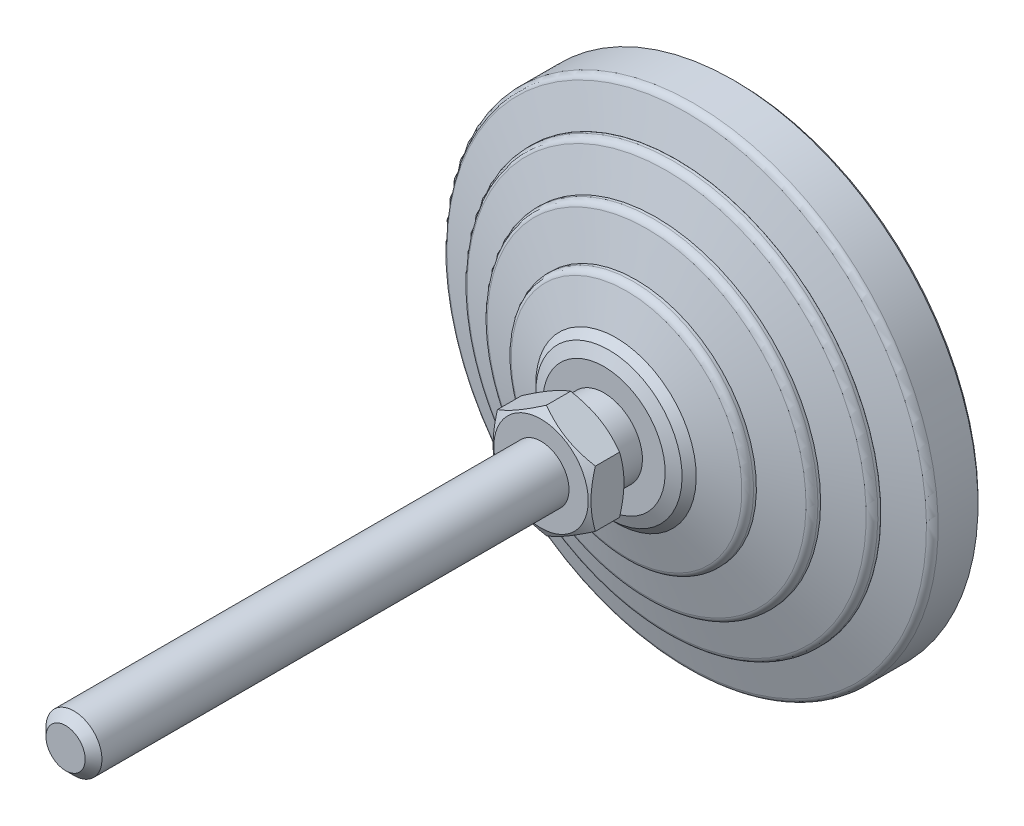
ISO-10303-21;
HEADER;
FILE_DESCRIPTION(('STEP AP214'),'2;1');
FILE_NAME('part.step','',(''),(''),'','','');
FILE_SCHEMA(('AUTOMOTIVE_DESIGN { 1 0 10303 214 1 1 1 1 }'));
ENDSEC;
DATA;
#1=APPLICATION_CONTEXT('core data for automotive mechanical design processes');
#2=APPLICATION_PROTOCOL_DEFINITION('international standard','automotive_design',2000,#1);
#3=PRODUCT_CONTEXT('',#1,'mechanical');
#4=PRODUCT('Part','Part','',(#3));
#5=PRODUCT_RELATED_PRODUCT_CATEGORY('part','',(#4));
#6=PRODUCT_DEFINITION_FORMATION('','',#4);
#7=PRODUCT_DEFINITION_CONTEXT('part definition',#1,'design');
#8=PRODUCT_DEFINITION('design','',#6,#7);
#9=PRODUCT_DEFINITION_SHAPE('','',#8);
#10=(LENGTH_UNIT() NAMED_UNIT(*) SI_UNIT(.MILLI.,.METRE.));
#11=(NAMED_UNIT(*) PLANE_ANGLE_UNIT() SI_UNIT($,.RADIAN.));
#12=(NAMED_UNIT(*) SI_UNIT($,.STERADIAN.) SOLID_ANGLE_UNIT());
#13=UNCERTAINTY_MEASURE_WITH_UNIT(LENGTH_MEASURE(1.E-05),#10,'distance_accuracy_value','');
#14=(GEOMETRIC_REPRESENTATION_CONTEXT(3) GLOBAL_UNCERTAINTY_ASSIGNED_CONTEXT((#13)) GLOBAL_UNIT_ASSIGNED_CONTEXT((#10,
#11,#12)) REPRESENTATION_CONTEXT('',''));
#15=CARTESIAN_POINT('',(0.,0.,0.));
#16=DIRECTION('',(0.,0.,1.));
#17=DIRECTION('',(1.,0.,0.));
#18=AXIS2_PLACEMENT_3D('',#15,#16,#17);
#19=CARTESIAN_POINT('',(-5.49999999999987,0.,23.));
#20=DIRECTION('',(0.,0.,1.));
#21=DIRECTION('',(0.,-1.,0.));
#22=AXIS2_PLACEMENT_3D('',#19,#20,#21);
#23=PLANE('',#22);
#24=CARTESIAN_POINT('',(0.,0.,23.));
#25=DIRECTION('',(0.,0.,1.));
#26=DIRECTION('',(1.,0.,0.));
#27=AXIS2_PLACEMENT_3D('',#24,#25,#26);
#28=CIRCLE('',#27,6.75);
#29=CARTESIAN_POINT('',(6.75,0.,23.));
#30=VERTEX_POINT('',#29);
#31=EDGE_CURVE('E570',#30,#30,#28,.T.);
#32=ORIENTED_EDGE('',*,*,#31,.F.);
#33=EDGE_LOOP('',(#32));
#34=FACE_BOUND('',#33,.T.);
#35=CARTESIAN_POINT('',(0.,0.,23.));
#36=DIRECTION('',(0.,0.,-1.));
#37=DIRECTION('',(0.,1.,0.));
#38=AXIS2_PLACEMENT_3D('',#35,#36,#37);
#39=CIRCLE('',#38,5.49999999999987);
#40=CARTESIAN_POINT('',(0.,5.49999999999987,23.));
#41=VERTEX_POINT('',#40);
#42=EDGE_CURVE('E150',#41,#41,#39,.T.);
#43=ORIENTED_EDGE('',*,*,#42,.F.);
#44=EDGE_LOOP('',(#43));
#45=FACE_BOUND('',#44,.T.);
#46=ADVANCED_FACE('F14',(#34,#45),#23,.F.);
#47=CARTESIAN_POINT('',(0.,0.,0.));
#48=DIRECTION('',(0.,0.,-1.));
#49=DIRECTION('',(0.,1.,0.));
#50=AXIS2_PLACEMENT_3D('',#47,#48,#49);
#51=CYLINDRICAL_SURFACE('',#50,5.49999999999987);
#52=CARTESIAN_POINT('',(0.,0.,19.));
#53=DIRECTION('',(0.,0.,-1.));
#54=DIRECTION('',(0.,1.,0.));
#55=AXIS2_PLACEMENT_3D('',#52,#53,#54);
#56=CIRCLE('',#55,5.49999999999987);
#57=CARTESIAN_POINT('',(0.,5.49999999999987,19.));
#58=VERTEX_POINT('',#57);
#59=EDGE_CURVE('E147',#58,#58,#56,.T.);
#60=ORIENTED_EDGE('',*,*,#59,.F.);
#61=EDGE_LOOP('',(#60));
#62=FACE_BOUND('',#61,.T.);
#63=ORIENTED_EDGE('',*,*,#42,.T.);
#64=EDGE_LOOP('',(#63));
#65=FACE_BOUND('',#64,.T.);
#66=ADVANCED_FACE('F174',(#62,#65),#51,.T.);
#67=CARTESIAN_POINT('',(-8.7540983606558,0.,19.));
#68=DIRECTION('',(0.,0.,-1.));
#69=DIRECTION('',(0.,1.,0.));
#70=AXIS2_PLACEMENT_3D('',#67,#68,#69);
#71=PLANE('',#70);
#72=CARTESIAN_POINT('',(0.,0.,19.));
#73=DIRECTION('',(0.,0.,-1.));
#74=DIRECTION('',(0.,1.,0.));
#75=AXIS2_PLACEMENT_3D('',#72,#73,#74);
#76=CIRCLE('',#75,8.7540983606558);
#77=CARTESIAN_POINT('',(0.,8.7540983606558,19.));
#78=VERTEX_POINT('',#77);
#79=EDGE_CURVE('E144',#78,#78,#76,.T.);
#80=ORIENTED_EDGE('',*,*,#79,.F.);
#81=EDGE_LOOP('',(#80));
#82=FACE_BOUND('',#81,.T.);
#83=ORIENTED_EDGE('',*,*,#59,.T.);
#84=EDGE_LOOP('',(#83));
#85=FACE_BOUND('',#84,.T.);
#86=ADVANCED_FACE('F181',(#82,#85),#71,.F.);
#87=CARTESIAN_POINT('',(0.,0.,19.));
#88=DIRECTION('',(0.,0.,-1.));
#89=DIRECTION('',(0.,1.,0.));
#90=AXIS2_PLACEMENT_3D('',#87,#88,#89);
#91=CONICAL_SURFACE('',#90,8.7540983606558,1.17809724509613);
#92=CARTESIAN_POINT('',(0.,0.,18.2928932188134));
#93=DIRECTION('',(0.,0.,-1.));
#94=DIRECTION('',(0.,1.,0.));
#95=AXIS2_PLACEMENT_3D('',#92,#93,#94);
#96=CIRCLE('',#95,10.4612051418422);
#97=CARTESIAN_POINT('',(0.,10.4612051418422,18.2928932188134));
#98=VERTEX_POINT('',#97);
#99=EDGE_CURVE('E141',#98,#98,#96,.T.);
#100=ORIENTED_EDGE('',*,*,#99,.F.);
#101=EDGE_LOOP('',(#100));
#102=FACE_BOUND('',#101,.T.);
#103=ORIENTED_EDGE('',*,*,#79,.T.);
#104=EDGE_LOOP('',(#103));
#105=FACE_BOUND('',#104,.T.);
#106=ADVANCED_FACE('F433',(#102,#105),#91,.T.);
#107=CARTESIAN_POINT('',(0.,0.,18.2928932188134));
#108=DIRECTION('',(0.,0.,-1.));
#109=DIRECTION('',(0.,1.,0.));
#110=AXIS2_PLACEMENT_3D('',#107,#108,#109);
#111=CONICAL_SURFACE('',#110,10.4612051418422,0.785398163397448);
#112=CARTESIAN_POINT('',(0.,0.,17.2786885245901));
#113=DIRECTION('',(0.,0.,-1.));
#114=DIRECTION('',(0.,1.,0.));
#115=AXIS2_PLACEMENT_3D('',#112,#113,#114);
#116=CIRCLE('',#115,11.4754098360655);
#117=CARTESIAN_POINT('',(0.,11.4754098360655,17.2786885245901));
#118=VERTEX_POINT('',#117);
#119=EDGE_CURVE('E138',#118,#118,#116,.T.);
#120=ORIENTED_EDGE('',*,*,#119,.F.);
#121=EDGE_LOOP('',(#120));
#122=FACE_BOUND('',#121,.T.);
#123=ORIENTED_EDGE('',*,*,#99,.T.);
#124=EDGE_LOOP('',(#123));
#125=FACE_BOUND('',#124,.T.);
#126=ADVANCED_FACE('F423',(#122,#125),#111,.T.);
#127=CARTESIAN_POINT('',(0.,0.,17.2786885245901));
#128=DIRECTION('',(0.,0.,-1.));
#129=DIRECTION('',(0.,1.,0.));
#130=AXIS2_PLACEMENT_3D('',#127,#128,#129);
#131=CONICAL_SURFACE('',#130,11.4754098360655,1.27933953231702);
#132=CARTESIAN_POINT('',(0.,0.,15.7711726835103));
#133=DIRECTION('',(0.,0.,-1.));
#134=DIRECTION('',(0.,1.,0.));
#135=AXIS2_PLACEMENT_3D('',#132,#133,#134);
#136=CIRCLE('',#135,16.5004626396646);
#137=CARTESIAN_POINT('',(0.,16.5004626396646,15.7711726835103));
#138=VERTEX_POINT('',#137);
#139=EDGE_CURVE('E135',#138,#138,#136,.T.);
#140=ORIENTED_EDGE('',*,*,#139,.F.);
#141=EDGE_LOOP('',(#140));
#142=FACE_BOUND('',#141,.T.);
#143=ORIENTED_EDGE('',*,*,#119,.T.);
#144=EDGE_LOOP('',(#143));
#145=FACE_BOUND('',#144,.T.);
#146=ADVANCED_FACE('F413',(#142,#145),#131,.T.);
#147=CARTESIAN_POINT('',(0.,0.,14.8133463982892));
#148=DIRECTION('',(0.,0.,-1.));
#149=DIRECTION('',(0.,1.,0.));
#150=AXIS2_PLACEMENT_3D('',#147,#148,#149);
#151=TOROIDAL_SURFACE('',#150,16.2131147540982,1.);
#152=CARTESIAN_POINT('',(0.,0.,14.8133463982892));
#153=DIRECTION('',(0.,0.,-1.));
#154=DIRECTION('',(0.,1.,0.));
#155=AXIS2_PLACEMENT_3D('',#152,#153,#154);
#156=CIRCLE('',#155,17.2131147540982);
#157=CARTESIAN_POINT('',(0.,17.2131147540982,14.8133463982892));
#158=VERTEX_POINT('',#157);
#159=EDGE_CURVE('E132',#158,#158,#156,.T.);
#160=ORIENTED_EDGE('',*,*,#159,.F.);
#161=EDGE_LOOP('',(#160));
#162=FACE_BOUND('',#161,.T.);
#163=ORIENTED_EDGE('',*,*,#139,.T.);
#164=EDGE_LOOP('',(#163));
#165=FACE_BOUND('',#164,.T.);
#166=ADVANCED_FACE('F403',(#162,#165),#151,.T.);
#167=CARTESIAN_POINT('',(0.,0.,0.));
#168=DIRECTION('',(0.,0.,-1.));
#169=DIRECTION('',(0.,1.,0.));
#170=AXIS2_PLACEMENT_3D('',#167,#168,#169);
#171=CYLINDRICAL_SURFACE('',#170,17.2131147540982);
#172=CARTESIAN_POINT('',(0.,0.,14.4098360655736));
#173=DIRECTION('',(0.,0.,-1.));
#174=DIRECTION('',(0.,1.,0.));
#175=AXIS2_PLACEMENT_3D('',#172,#173,#174);
#176=CIRCLE('',#175,17.2131147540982);
#177=CARTESIAN_POINT('',(0.,17.2131147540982,14.4098360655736));
#178=VERTEX_POINT('',#177);
#179=EDGE_CURVE('E129',#178,#178,#176,.T.);
#180=ORIENTED_EDGE('',*,*,#179,.F.);
#181=EDGE_LOOP('',(#180));
#182=FACE_BOUND('',#181,.T.);
#183=ORIENTED_EDGE('',*,*,#159,.T.);
#184=EDGE_LOOP('',(#183));
#185=FACE_BOUND('',#184,.T.);
#186=ADVANCED_FACE('F393',(#182,#185),#171,.T.);
#187=CARTESIAN_POINT('',(0.,0.,14.4098360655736));
#188=DIRECTION('',(0.,0.,-1.));
#189=DIRECTION('',(0.,1.,0.));
#190=AXIS2_PLACEMENT_3D('',#187,#188,#189);
#191=CONICAL_SURFACE('',#190,17.2131147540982,1.30454427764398);
#192=CARTESIAN_POINT('',(0.,0.,12.8894925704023));
#193=DIRECTION('',(0.,0.,-1.));
#194=DIRECTION('',(0.,1.,0.));
#195=AXIS2_PLACEMENT_3D('',#192,#193,#194);
#196=CIRCLE('',#195,22.7877075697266);
#197=CARTESIAN_POINT('',(0.,22.7877075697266,12.8894925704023));
#198=VERTEX_POINT('',#197);
#199=EDGE_CURVE('E126',#198,#198,#196,.T.);
#200=ORIENTED_EDGE('',*,*,#199,.F.);
#201=EDGE_LOOP('',(#200));
#202=FACE_BOUND('',#201,.T.);
#203=ORIENTED_EDGE('',*,*,#179,.T.);
#204=EDGE_LOOP('',(#203));
#205=FACE_BOUND('',#204,.T.);
#206=ADVANCED_FACE('F383',(#202,#205),#191,.T.);
#207=CARTESIAN_POINT('',(0.,0.,11.9247287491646));
#208=DIRECTION('',(0.,0.,-1.));
#209=DIRECTION('',(0.,1.,0.));
#210=AXIS2_PLACEMENT_3D('',#207,#208,#209);
#211=TOROIDAL_SURFACE('',#210,22.5245901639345,1.);
#212=CARTESIAN_POINT('',(0.,0.,11.9247287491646));
#213=DIRECTION('',(0.,0.,-1.));
#214=DIRECTION('',(0.,1.,0.));
#215=AXIS2_PLACEMENT_3D('',#212,#213,#214);
#216=CIRCLE('',#215,23.5245901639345);
#217=CARTESIAN_POINT('',(0.,23.5245901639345,11.9247287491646));
#218=VERTEX_POINT('',#217);
#219=EDGE_CURVE('E123',#218,#218,#216,.T.);
#220=ORIENTED_EDGE('',*,*,#219,.F.);
#221=EDGE_LOOP('',(#220));
#222=FACE_BOUND('',#221,.T.);
#223=ORIENTED_EDGE('',*,*,#199,.T.);
#224=EDGE_LOOP('',(#223));
#225=FACE_BOUND('',#224,.T.);
#226=ADVANCED_FACE('F373',(#222,#225),#211,.T.);
#227=CARTESIAN_POINT('',(0.,0.,0.));
#228=DIRECTION('',(0.,0.,-1.));
#229=DIRECTION('',(0.,1.,0.));
#230=AXIS2_PLACEMENT_3D('',#227,#228,#229);
#231=CYLINDRICAL_SURFACE('',#230,23.5245901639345);
#232=CARTESIAN_POINT('',(0.,0.,11.5409836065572));
#233=DIRECTION('',(0.,0.,-1.));
#234=DIRECTION('',(0.,1.,0.));
#235=AXIS2_PLACEMENT_3D('',#232,#233,#234);
#236=CIRCLE('',#235,23.5245901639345);
#237=CARTESIAN_POINT('',(0.,23.5245901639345,11.5409836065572));
#238=VERTEX_POINT('',#237);
#239=EDGE_CURVE('E120',#238,#238,#236,.T.);
#240=ORIENTED_EDGE('',*,*,#239,.F.);
#241=EDGE_LOOP('',(#240));
#242=FACE_BOUND('',#241,.T.);
#243=ORIENTED_EDGE('',*,*,#219,.T.);
#244=EDGE_LOOP('',(#243));
#245=FACE_BOUND('',#244,.T.);
#246=ADVANCED_FACE('F363',(#242,#245),#231,.T.);
#247=CARTESIAN_POINT('',(0.,0.,11.5409836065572));
#248=DIRECTION('',(0.,0.,-1.));
#249=DIRECTION('',(0.,1.,0.));
#250=AXIS2_PLACEMENT_3D('',#247,#248,#249);
#251=CONICAL_SURFACE('',#250,23.5245901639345,1.2787125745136);
#252=CARTESIAN_POINT('',(0.,0.,10.0337743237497));
#253=DIRECTION('',(0.,0.,-1.));
#254=DIRECTION('',(0.,1.,0.));
#255=AXIS2_PLACEMENT_3D('',#252,#253,#254);
#256=CIRCLE('',#255,28.5372004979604);
#257=CARTESIAN_POINT('',(0.,28.5372004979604,10.0337743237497));
#258=VERTEX_POINT('',#257);
#259=EDGE_CURVE('E117',#258,#258,#256,.T.);
#260=ORIENTED_EDGE('',*,*,#259,.F.);
#261=EDGE_LOOP('',(#260));
#262=FACE_BOUND('',#261,.T.);
#263=ORIENTED_EDGE('',*,*,#239,.T.);
#264=EDGE_LOOP('',(#263));
#265=FACE_BOUND('',#264,.T.);
#266=ADVANCED_FACE('F353',(#262,#265),#251,.T.);
#267=CARTESIAN_POINT('',(0.,0.,9.07612838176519));
#268=DIRECTION('',(0.,0.,-1.));
#269=DIRECTION('',(0.,1.,0.));
#270=AXIS2_PLACEMENT_3D('',#267,#268,#269);
#271=TOROIDAL_SURFACE('',#270,28.2492521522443,1.);
#272=CARTESIAN_POINT('',(0.,0.,9.07612838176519));
#273=DIRECTION('',(0.,0.,-1.));
#274=DIRECTION('',(0.,1.,0.));
#275=AXIS2_PLACEMENT_3D('',#272,#273,#274);
#276=CIRCLE('',#275,29.2492521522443);
#277=CARTESIAN_POINT('',(0.,29.2492521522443,9.07612838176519));
#278=VERTEX_POINT('',#277);
#279=EDGE_CURVE('E114',#278,#278,#276,.T.);
#280=ORIENTED_EDGE('',*,*,#279,.F.);
#281=EDGE_LOOP('',(#280));
#282=FACE_BOUND('',#281,.T.);
#283=ORIENTED_EDGE('',*,*,#259,.T.);
#284=EDGE_LOOP('',(#283));
#285=FACE_BOUND('',#284,.T.);
#286=ADVANCED_FACE('F343',(#282,#285),#271,.T.);
#287=CARTESIAN_POINT('',(0.,0.,0.));
#288=DIRECTION('',(0.,0.,-1.));
#289=DIRECTION('',(0.,1.,0.));
#290=AXIS2_PLACEMENT_3D('',#287,#288,#289);
#291=CYLINDRICAL_SURFACE('',#290,29.2492521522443);
#292=CARTESIAN_POINT('',(0.,0.,8.67213114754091));
#293=DIRECTION('',(0.,0.,-1.));
#294=DIRECTION('',(0.,1.,0.));
#295=AXIS2_PLACEMENT_3D('',#292,#293,#294);
#296=CIRCLE('',#295,29.2492521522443);
#297=CARTESIAN_POINT('',(0.,29.2492521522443,8.67213114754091));
#298=VERTEX_POINT('',#297);
#299=EDGE_CURVE('E111',#298,#298,#296,.T.);
#300=ORIENTED_EDGE('',*,*,#299,.F.);
#301=EDGE_LOOP('',(#300));
#302=FACE_BOUND('',#301,.T.);
#303=ORIENTED_EDGE('',*,*,#279,.T.);
#304=EDGE_LOOP('',(#303));
#305=FACE_BOUND('',#304,.T.);
#306=ADVANCED_FACE('F333',(#302,#305),#291,.T.);
#307=CARTESIAN_POINT('',(-29.2622950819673,0.,8.67213114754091));
#308=DIRECTION('',(0.,0.,-1.));
#309=DIRECTION('',(0.,1.,0.));
#310=AXIS2_PLACEMENT_3D('',#307,#308,#309);
#311=PLANE('',#310);
#312=CARTESIAN_POINT('',(0.,0.,8.67213114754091));
#313=DIRECTION('',(0.,0.,-1.));
#314=DIRECTION('',(0.,1.,0.));
#315=AXIS2_PLACEMENT_3D('',#312,#313,#314);
#316=CIRCLE('',#315,29.2622950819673);
#317=CARTESIAN_POINT('',(0.,29.2622950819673,8.67213114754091));
#318=VERTEX_POINT('',#317);
#319=EDGE_CURVE('E108',#318,#318,#316,.T.);
#320=ORIENTED_EDGE('',*,*,#319,.F.);
#321=EDGE_LOOP('',(#320));
#322=FACE_BOUND('',#321,.T.);
#323=ORIENTED_EDGE('',*,*,#299,.T.);
#324=EDGE_LOOP('',(#323));
#325=FACE_BOUND('',#324,.T.);
#326=ADVANCED_FACE('F323',(#322,#325),#311,.F.);
#327=CARTESIAN_POINT('',(0.,0.,8.67213114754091));
#328=DIRECTION('',(0.,0.,-1.));
#329=DIRECTION('',(0.,1.,0.));
#330=AXIS2_PLACEMENT_3D('',#327,#328,#329);
#331=CONICAL_SURFACE('',#330,29.2622950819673,1.27933953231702);
#332=CARTESIAN_POINT('',(0.,0.,7.16461530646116));
#333=DIRECTION('',(0.,0.,-1.));
#334=DIRECTION('',(0.,1.,0.));
#335=AXIS2_PLACEMENT_3D('',#332,#333,#334);
#336=CIRCLE('',#335,34.2873478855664);
#337=CARTESIAN_POINT('',(0.,34.2873478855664,7.16461530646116));
#338=VERTEX_POINT('',#337);
#339=EDGE_CURVE('E105',#338,#338,#336,.T.);
#340=ORIENTED_EDGE('',*,*,#339,.F.);
#341=EDGE_LOOP('',(#340));
#342=FACE_BOUND('',#341,.T.);
#343=ORIENTED_EDGE('',*,*,#319,.T.);
#344=EDGE_LOOP('',(#343));
#345=FACE_BOUND('',#344,.T.);
#346=ADVANCED_FACE('F313',(#342,#345),#331,.T.);
#347=CARTESIAN_POINT('',(0.,0.,6.20678902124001));
#348=DIRECTION('',(0.,0.,-1.));
#349=DIRECTION('',(0.,1.,0.));
#350=AXIS2_PLACEMENT_3D('',#347,#348,#349);
#351=TOROIDAL_SURFACE('',#350,34.,1.);
#352=CARTESIAN_POINT('',(0.,0.,6.20678902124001));
#353=DIRECTION('',(0.,0.,-1.));
#354=DIRECTION('',(0.,1.,0.));
#355=AXIS2_PLACEMENT_3D('',#352,#353,#354);
#356=CIRCLE('',#355,35.);
#357=CARTESIAN_POINT('',(0.,35.,6.20678902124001));
#358=VERTEX_POINT('',#357);
#359=EDGE_CURVE('E102',#358,#358,#356,.T.);
#360=ORIENTED_EDGE('',*,*,#359,.F.);
#361=EDGE_LOOP('',(#360));
#362=FACE_BOUND('',#361,.T.);
#363=ORIENTED_EDGE('',*,*,#339,.T.);
#364=EDGE_LOOP('',(#363));
#365=FACE_BOUND('',#364,.T.);
#366=ADVANCED_FACE('F303',(#362,#365),#351,.T.);
#367=CARTESIAN_POINT('',(0.,0.,0.));
#368=DIRECTION('',(0.,0.,-1.));
#369=DIRECTION('',(0.,1.,0.));
#370=AXIS2_PLACEMENT_3D('',#367,#368,#369);
#371=CYLINDRICAL_SURFACE('',#370,35.);
#372=CARTESIAN_POINT('',(0.,0.,0.5));
#373=DIRECTION('',(0.,0.,-1.));
#374=DIRECTION('',(0.,1.,0.));
#375=AXIS2_PLACEMENT_3D('',#372,#373,#374);
#376=CIRCLE('',#375,35.);
#377=CARTESIAN_POINT('',(0.,35.,0.5));
#378=VERTEX_POINT('',#377);
#379=EDGE_CURVE('E99',#378,#378,#376,.T.);
#380=ORIENTED_EDGE('',*,*,#379,.F.);
#381=EDGE_LOOP('',(#380));
#382=FACE_BOUND('',#381,.T.);
#383=ORIENTED_EDGE('',*,*,#359,.T.);
#384=EDGE_LOOP('',(#383));
#385=FACE_BOUND('',#384,.T.);
#386=ADVANCED_FACE('F293',(#382,#385),#371,.T.);
#387=CARTESIAN_POINT('',(0.,0.,0.5));
#388=DIRECTION('',(0.,0.,1.));
#389=DIRECTION('',(0.,-1.,0.));
#390=AXIS2_PLACEMENT_3D('',#387,#388,#389);
#391=CONICAL_SURFACE('',#390,35.,0.785398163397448);
#392=CARTESIAN_POINT('',(0.,0.,0.));
#393=DIRECTION('',(0.,0.,-1.));
#394=DIRECTION('',(0.,1.,0.));
#395=AXIS2_PLACEMENT_3D('',#392,#393,#394);
#396=CIRCLE('',#395,34.5);
#397=CARTESIAN_POINT('',(0.,34.5,0.));
#398=VERTEX_POINT('',#397);
#399=EDGE_CURVE('E96',#398,#398,#396,.T.);
#400=ORIENTED_EDGE('',*,*,#399,.F.);
#401=EDGE_LOOP('',(#400));
#402=FACE_BOUND('',#401,.T.);
#403=ORIENTED_EDGE('',*,*,#379,.T.);
#404=EDGE_LOOP('',(#403));
#405=FACE_BOUND('',#404,.T.);
#406=ADVANCED_FACE('F282',(#402,#405),#391,.T.);
#407=CARTESIAN_POINT('',(-34.5,0.,0.));
#408=DIRECTION('',(0.,0.,1.));
#409=DIRECTION('',(0.,-1.,0.));
#410=AXIS2_PLACEMENT_3D('',#407,#408,#409);
#411=PLANE('',#410);
#412=ORIENTED_EDGE('',*,*,#399,.T.);
#413=EDGE_LOOP('',(#412));
#414=FACE_BOUND('',#413,.T.);
#415=ADVANCED_FACE('F172',(#414),#411,.F.);
#416=CARTESIAN_POINT('',(0.,0.,23.));
#417=DIRECTION('',(0.,0.,1.));
#418=DIRECTION('',(1.,0.,0.));
#419=AXIS2_PLACEMENT_3D('',#416,#417,#418);
#420=CONICAL_SURFACE('',#419,6.75,1.0471975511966);
#421=CARTESIAN_POINT('',(0.000200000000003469,-8.0830192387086,23.7696190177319));
#422=CARTESIAN_POINT('',(-0.153667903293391,-7.99418356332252,23.7183374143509));
#423=CARTESIAN_POINT('',(-0.308109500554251,-7.90501666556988,23.669383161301));
#424=CARTESIAN_POINT('',(-0.618246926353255,-7.72595873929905,23.5767703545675));
#425=CARTESIAN_POINT('',(-0.773943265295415,-7.63606741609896,23.5331140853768));
#426=CARTESIAN_POINT('',(-1.24352516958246,-7.36495417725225,23.4109491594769));
#427=CARTESIAN_POINT('',(-1.5592643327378,-7.18266208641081,23.3414631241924));
#428=CARTESIAN_POINT('',(-2.03176224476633,-6.90986528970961,23.2599825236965));
#429=CARTESIAN_POINT('',(-2.18710922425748,-6.82017566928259,23.2367710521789));
#430=CARTESIAN_POINT('',(-2.49850511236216,-6.64039116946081,23.1978487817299));
#431=CARTESIAN_POINT('',(-2.65455395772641,-6.55029632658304,23.1821373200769));
#432=CARTESIAN_POINT('',(-2.96692267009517,-6.36995016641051,23.1586154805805));
#433=CARTESIAN_POINT('',(-3.12324202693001,-6.27969914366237,23.1507961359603));
#434=CARTESIAN_POINT('',(-3.43601650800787,-6.09911871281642,23.1432178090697));
#435=CARTESIAN_POINT('',(-3.59247162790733,-6.00878930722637,23.1434585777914));
#436=CARTESIAN_POINT('',(-4.02110687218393,-5.76131663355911,23.155197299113));
#437=CARTESIAN_POINT('',(-4.2931466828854,-5.60425437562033,23.1749033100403));
#438=CARTESIAN_POINT('',(-4.83541944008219,-5.29117305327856,23.2373910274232));
#439=CARTESIAN_POINT('',(-5.10565047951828,-5.13515508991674,23.2801940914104));
#440=CARTESIAN_POINT('',(-5.64901454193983,-4.82144370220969,23.3871892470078));
#441=CARTESIAN_POINT('',(-5.92207900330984,-4.6637898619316,23.4518346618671));
#442=CARTESIAN_POINT('',(-6.46413578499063,-4.35083323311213,23.5985536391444));
#443=CARTESIAN_POINT('',(-6.73313504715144,-4.19552643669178,23.680592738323));
#444=CARTESIAN_POINT('',(-7.0002,-4.04133641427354,23.7696190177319));
#445=B_SPLINE_CURVE_WITH_KNOTS('',3,(#421,#422,#423,#424,#425,#426,#427,#428,#429,#430,#431,
#432,#433,#434,#435,#436,#437,#438,#439,#440,#441,#442,#443,#444),.UNSPECIFIED.,.F.,.F.,(4,2,2,
2,2,2,2,2,2,2,2,4),(0.,0.554727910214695,1.10969417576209,2.2219327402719,2.76443041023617,
3.30688013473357,3.8487128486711,4.39052882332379,5.33376515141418,6.27787517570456,
7.2429241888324,8.20607866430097),.UNSPECIFIED.);
#446=CARTESIAN_POINT('',(0.,-8.08290376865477,23.7695523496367));
#447=VERTEX_POINT('',#446);
#448=CARTESIAN_POINT('',(-7.,-4.04145188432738,23.7695523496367));
#449=VERTEX_POINT('',#448);
#450=EDGE_CURVE('E73',#447,#449,#445,.T.);
#451=ORIENTED_EDGE('',*,*,#450,.T.);
#452=CARTESIAN_POINT('',(-7.,-10.8443618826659,26.5549588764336));
#453=CARTESIAN_POINT('',(-7.,-10.5387211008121,26.4067418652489));
#454=CARTESIAN_POINT('',(-7.,-10.2323774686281,26.259949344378));
#455=CARTESIAN_POINT('',(-7.,-9.61791067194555,25.9700146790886));
#456=CARTESIAN_POINT('',(-7.,-9.30978723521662,25.8268731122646));
#457=CARTESIAN_POINT('',(-7.,-8.68979396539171,25.5443191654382));
#458=CARTESIAN_POINT('',(-7.,-8.37791286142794,25.4049314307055));
#459=CARTESIAN_POINT('',(-7.,-7.75166608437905,25.1318755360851));
#460=CARTESIAN_POINT('',(-7.,-7.43730052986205,24.9982071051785));
#461=CARTESIAN_POINT('',(-7.,-6.79548330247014,24.7339410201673));
#462=CARTESIAN_POINT('',(-7.,-6.46793447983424,24.6035780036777));
#463=CARTESIAN_POINT('',(-7.,-5.80900129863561,24.3527460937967));
#464=CARTESIAN_POINT('',(-7.,-5.47761651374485,24.2322783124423));
#465=CARTESIAN_POINT('',(-7.,-4.8111041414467,24.0044081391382));
#466=CARTESIAN_POINT('',(-7.,-4.47598572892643,23.8969792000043));
#467=CARTESIAN_POINT('',(-7.,-3.80095392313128,23.6986400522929));
#468=CARTESIAN_POINT('',(-7.,-3.46104208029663,23.6077246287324));
#469=CARTESIAN_POINT('',(-7.,-2.77805759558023,23.4472719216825));
#470=CARTESIAN_POINT('',(-7.,-2.43501282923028,23.3776191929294));
#471=CARTESIAN_POINT('',(-7.,-1.91733098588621,23.2921084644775));
#472=CARTESIAN_POINT('',(-7.,-1.7442384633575,23.2667651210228));
#473=CARTESIAN_POINT('',(-7.,-1.39719696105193,23.2228985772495));
#474=CARTESIAN_POINT('',(-7.,-1.22324806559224,23.2043747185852));
#475=CARTESIAN_POINT('',(-7.,-0.876994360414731,23.1747479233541));
#476=CARTESIAN_POINT('',(-7.,-0.704697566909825,23.163551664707));
#477=CARTESIAN_POINT('',(-7.,-0.35978498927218,23.1484544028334));
#478=CARTESIAN_POINT('',(-7.,-0.187169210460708,23.1445532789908));
#479=CARTESIAN_POINT('',(-7.,0.158072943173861,23.1441393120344));
#480=CARTESIAN_POINT('',(-7.,0.330699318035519,23.1476264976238));
#481=CARTESIAN_POINT('',(-7.,0.675651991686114,23.1619041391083));
#482=CARTESIAN_POINT('',(-7.,0.847978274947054,23.1726949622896));
#483=CARTESIAN_POINT('',(-7.,1.26247664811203,23.2072063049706));
#484=CARTESIAN_POINT('',(-7.,1.50436469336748,23.2344113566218));
#485=CARTESIAN_POINT('',(-7.,1.98632659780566,23.301724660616));
#486=CARTESIAN_POINT('',(-7.,2.22640020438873,23.3418346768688));
#487=CARTESIAN_POINT('',(-7.,2.94363539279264,23.4793937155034));
#488=CARTESIAN_POINT('',(-7.,3.41754011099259,23.5940461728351));
#489=CARTESIAN_POINT('',(-7.,4.1261416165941,23.7926298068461));
#490=CARTESIAN_POINT('',(-7.,4.36451972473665,23.8641784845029));
#491=CARTESIAN_POINT('',(-7.,4.83896021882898,24.0146489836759));
#492=CARTESIAN_POINT('',(-7.,5.07502258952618,24.0935708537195));
#493=CARTESIAN_POINT('',(-7.,5.54490701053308,24.2575262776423));
#494=CARTESIAN_POINT('',(-7.,5.77872978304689,24.342557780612));
#495=CARTESIAN_POINT('',(-7.,6.24444190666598,24.51773778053));
#496=CARTESIAN_POINT('',(-7.,6.47633128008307,24.6078862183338));
#497=CARTESIAN_POINT('',(-7.,7.0222547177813,24.8259469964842));
#498=CARTESIAN_POINT('',(-7.,7.3355560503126,24.9556903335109));
#499=CARTESIAN_POINT('',(-7.,7.95950728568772,25.2214212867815));
#500=CARTESIAN_POINT('',(-7.,8.27015702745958,25.3574092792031));
#501=CARTESIAN_POINT('',(-7.,8.88929124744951,25.6343787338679));
#502=CARTESIAN_POINT('',(-7.,9.19777527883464,25.7753611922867));
#503=CARTESIAN_POINT('',(-7.,9.81288862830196,26.0613228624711));
#504=CARTESIAN_POINT('',(-7.,10.1195179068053,26.2063021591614));
#505=CARTESIAN_POINT('',(-7.,10.7315433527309,26.499661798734));
#506=CARTESIAN_POINT('',(-7.,11.0369378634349,26.6480455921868));
#507=CARTESIAN_POINT('',(-7.,11.6464134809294,26.9474889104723));
#508=CARTESIAN_POINT('',(-7.,11.9504945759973,27.0985484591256));
#509=CARTESIAN_POINT('',(-7.,12.8610005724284,27.5549906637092));
#510=CARTESIAN_POINT('',(-7.,13.4657695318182,27.8636761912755));
#511=CARTESIAN_POINT('',(-7.,14.62168145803,28.4611857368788));
#512=CARTESIAN_POINT('',(-7.,15.1730820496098,28.7495135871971));
#513=CARTESIAN_POINT('',(-7.,16.2738343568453,29.3300977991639));
#514=CARTESIAN_POINT('',(-7.,16.8231859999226,29.6223542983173));
#515=CARTESIAN_POINT('',(-7.,17.9189307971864,30.2091323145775));
#516=CARTESIAN_POINT('',(-7.,18.4653279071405,30.5036464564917));
#517=CARTESIAN_POINT('',(-7.,19.5568115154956,31.0950233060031));
#518=CARTESIAN_POINT('',(-7.,20.1018980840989,31.3918858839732));
#519=CARTESIAN_POINT('',(-7.,20.6465020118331,31.6896253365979));
#520=B_SPLINE_CURVE_WITH_KNOTS('',3,(#452,#453,#454,#455,#456,#457,#458,#459,#460,#461,#462,
#463,#464,#465,#466,#467,#468,#469,#470,#471,#472,#473,#474,#475,#476,#477,#478,#479,#480,#481,
#482,#483,#484,#485,#486,#487,#488,#489,#490,#491,#492,#493,#494,#495,#496,#497,#498,#499,#500,
#501,#502,#503,#504,#505,#506,#507,#508,#509,#510,#511,#512,#513,#514,#515,#516,#517,#518,#519),
.UNSPECIFIED.,.F.,.F.,(4,2,2,2,2,2,2,2,2,2,2,2,2,2,2,2,2,2,2,2,2,2,2,2,2,2,2,2,2,2,2,2,2,4),(0.,
1.01906162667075,2.03828348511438,3.0630734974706,4.08781489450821,5.14530359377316,
6.20291097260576,7.25832758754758,8.31341031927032,9.36265821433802,9.8873590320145,
10.41200918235,10.9298403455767,11.4476629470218,11.9654875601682,12.4833382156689,
13.2131648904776,13.9430913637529,15.4037579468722,16.1503488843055,16.8969447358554,
17.6432911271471,18.389628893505,19.4068476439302,20.4241277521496,21.4416119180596,
22.459117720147,23.4777048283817,24.496301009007,26.5332223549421,28.3999084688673,
30.2666600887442,32.1288020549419,33.9908419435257),.UNSPECIFIED.);
#521=CARTESIAN_POINT('',(-7.,4.04145188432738,23.7695523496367));
#522=VERTEX_POINT('',#521);
#523=EDGE_CURVE('E81',#449,#522,#520,.T.);
#524=ORIENTED_EDGE('',*,*,#523,.T.);
#525=CARTESIAN_POINT('',(-7.0002,4.04133641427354,23.7696190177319));
#526=CARTESIAN_POINT('',(-6.84633209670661,4.13017208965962,23.7183374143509));
#527=CARTESIAN_POINT('',(-6.69189049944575,4.21933898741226,23.669383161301));
#528=CARTESIAN_POINT('',(-6.38175307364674,4.39839691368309,23.5767703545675));
#529=CARTESIAN_POINT('',(-6.22605673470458,4.48828823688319,23.5331140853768));
#530=CARTESIAN_POINT('',(-5.75647483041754,4.75940147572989,23.4109491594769));
#531=CARTESIAN_POINT('',(-5.4407356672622,4.94169356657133,23.3414631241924));
#532=CARTESIAN_POINT('',(-4.96823775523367,5.21449036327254,23.2599825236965));
#533=CARTESIAN_POINT('',(-4.81289077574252,5.30417998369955,23.2367710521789));
#534=CARTESIAN_POINT('',(-4.50149488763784,5.48396448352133,23.1978487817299));
#535=CARTESIAN_POINT('',(-4.34544604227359,5.57405932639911,23.1821373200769));
#536=CARTESIAN_POINT('',(-4.03307732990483,5.75440548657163,23.1586154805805));
#537=CARTESIAN_POINT('',(-3.87675797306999,5.84465650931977,23.1507961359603));
#538=CARTESIAN_POINT('',(-3.56398349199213,6.02523694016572,23.1432178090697));
#539=CARTESIAN_POINT('',(-3.40752837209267,6.11556634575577,23.1434585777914));
#540=CARTESIAN_POINT('',(-2.97889312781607,6.36303901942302,23.155197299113));
#541=CARTESIAN_POINT('',(-2.7068533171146,6.52010127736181,23.1749033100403));
#542=CARTESIAN_POINT('',(-2.16458055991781,6.83318259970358,23.2373910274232));
#543=CARTESIAN_POINT('',(-1.89434952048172,6.9892005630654,23.2801940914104));
#544=CARTESIAN_POINT('',(-1.35098545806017,7.30291195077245,23.3871892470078));
#545=CARTESIAN_POINT('',(-1.07792099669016,7.46056579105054,23.4518346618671));
#546=CARTESIAN_POINT('',(-0.535864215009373,7.77352241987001,23.5985536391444));
#547=CARTESIAN_POINT('',(-0.266864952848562,7.92882921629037,23.680592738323));
#548=CARTESIAN_POINT('',(0.000199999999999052,8.0830192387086,23.7696190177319));
#549=B_SPLINE_CURVE_WITH_KNOTS('',3,(#525,#526,#527,#528,#529,#530,#531,#532,#533,#534,#535,
#536,#537,#538,#539,#540,#541,#542,#543,#544,#545,#546,#547,#548),.UNSPECIFIED.,.F.,.F.,(4,2,2,
2,2,2,2,2,2,2,2,4),(0.,0.554727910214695,1.10969417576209,2.2219327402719,2.76443041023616,
3.30688013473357,3.84871284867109,4.39052882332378,5.33376515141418,6.27787517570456,
7.2429241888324,8.20607866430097),.UNSPECIFIED.);
#550=CARTESIAN_POINT('',(0.,8.08290376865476,23.7695523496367));
#551=VERTEX_POINT('',#550);
#552=EDGE_CURVE('E525',#522,#551,#549,.T.);
#553=ORIENTED_EDGE('',*,*,#552,.T.);
#554=CARTESIAN_POINT('',(-0.000200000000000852,8.0830192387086,23.7696190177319));
#555=CARTESIAN_POINT('',(0.153667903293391,7.99418356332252,23.7183374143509));
#556=CARTESIAN_POINT('',(0.30810950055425,7.90501666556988,23.669383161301));
#557=CARTESIAN_POINT('',(0.618246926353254,7.72595873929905,23.5767703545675));
#558=CARTESIAN_POINT('',(0.773943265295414,7.63606741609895,23.5331140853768));
#559=CARTESIAN_POINT('',(1.24352516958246,7.36495417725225,23.4109491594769));
#560=CARTESIAN_POINT('',(1.5592643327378,7.18266208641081,23.3414631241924));
#561=CARTESIAN_POINT('',(2.03176224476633,6.9098652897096,23.2599825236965));
#562=CARTESIAN_POINT('',(2.18710922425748,6.82017566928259,23.2367710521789));
#563=CARTESIAN_POINT('',(2.49850511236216,6.64039116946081,23.1978487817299));
#564=CARTESIAN_POINT('',(2.65455395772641,6.55029632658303,23.1821373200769));
#565=CARTESIAN_POINT('',(2.96692267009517,6.36995016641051,23.1586154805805));
#566=CARTESIAN_POINT('',(3.12324202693,6.27969914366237,23.1507961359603));
#567=CARTESIAN_POINT('',(3.43601650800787,6.09911871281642,23.1432178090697));
#568=CARTESIAN_POINT('',(3.59247162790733,6.00878930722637,23.1434585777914));
#569=CARTESIAN_POINT('',(4.02110687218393,5.76131663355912,23.155197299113));
#570=CARTESIAN_POINT('',(4.2931466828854,5.60425437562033,23.1749033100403));
#571=CARTESIAN_POINT('',(4.83541944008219,5.29117305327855,23.2373910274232));
#572=CARTESIAN_POINT('',(5.10565047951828,5.13515508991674,23.2801940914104));
#573=CARTESIAN_POINT('',(5.64901454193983,4.82144370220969,23.3871892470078));
#574=CARTESIAN_POINT('',(5.92207900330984,4.66378986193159,23.4518346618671));
#575=CARTESIAN_POINT('',(6.46413578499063,4.35083323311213,23.5985536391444));
#576=CARTESIAN_POINT('',(6.73313504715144,4.19552643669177,23.680592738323));
#577=CARTESIAN_POINT('',(7.0002,4.04133641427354,23.7696190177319));
#578=B_SPLINE_CURVE_WITH_KNOTS('',3,(#554,#555,#556,#557,#558,#559,#560,#561,#562,#563,#564,
#565,#566,#567,#568,#569,#570,#571,#572,#573,#574,#575,#576,#577),.UNSPECIFIED.,.F.,.F.,(4,2,2,
2,2,2,2,2,2,2,2,4),(0.,0.554727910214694,1.10969417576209,2.2219327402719,2.76443041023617,
3.30688013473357,3.84871284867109,4.39052882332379,5.33376515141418,6.27787517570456,
7.2429241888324,8.20607866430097),.UNSPECIFIED.);
#579=CARTESIAN_POINT('',(7.,4.04145188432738,23.7695523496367));
#580=VERTEX_POINT('',#579);
#581=EDGE_CURVE('E520',#551,#580,#578,.T.);
#582=ORIENTED_EDGE('',*,*,#581,.T.);
#583=CARTESIAN_POINT('',(7.,-10.8443618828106,26.5549588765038));
#584=CARTESIAN_POINT('',(7.,-10.5387211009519,26.4067418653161));
#585=CARTESIAN_POINT('',(7.,-10.232377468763,26.2599493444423));
#586=CARTESIAN_POINT('',(7.,-9.61791067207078,25.970014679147));
#587=CARTESIAN_POINT('',(7.,-9.30978723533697,25.8268731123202));
#588=CARTESIAN_POINT('',(7.,-8.68979396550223,25.5443191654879));
#589=CARTESIAN_POINT('',(7.,-8.3779128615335,25.4049314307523));
#590=CARTESIAN_POINT('',(7.,-7.75166608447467,25.1318755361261));
#591=CARTESIAN_POINT('',(7.,-7.43730052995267,24.9982071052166));
#592=CARTESIAN_POINT('',(7.,-6.79548330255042,24.7339410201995));
#593=CARTESIAN_POINT('',(7.,-6.46793447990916,24.603578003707));
#594=CARTESIAN_POINT('',(7.,-5.80900129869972,24.3527460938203));
#595=CARTESIAN_POINT('',(7.,-5.47761651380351,24.2322783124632));
#596=CARTESIAN_POINT('',(7.,-4.81110414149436,24.0044081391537));
#597=CARTESIAN_POINT('',(7.,-4.47598572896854,23.8969792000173));
#598=CARTESIAN_POINT('',(7.,-3.80095392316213,23.6986400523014));
#599=CARTESIAN_POINT('',(7.,-3.46104208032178,23.6077246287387));
#600=CARTESIAN_POINT('',(7.,-2.77805759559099,23.4472719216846));
#601=CARTESIAN_POINT('',(7.,-2.43501282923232,23.3776191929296));
#602=CARTESIAN_POINT('',(7.,-1.917330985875,23.2921084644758));
#603=CARTESIAN_POINT('',(7.,-1.74423846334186,23.2667651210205));
#604=CARTESIAN_POINT('',(7.,-1.39719696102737,23.2228985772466));
#605=CARTESIAN_POINT('',(7.,-1.22324806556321,23.2043747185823));
#606=CARTESIAN_POINT('',(7.,-0.876994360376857,23.1747479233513));
#607=CARTESIAN_POINT('',(7.,-0.704697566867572,23.1635516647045));
#608=CARTESIAN_POINT('',(7.,-0.35978498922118,23.1484544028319));
#609=CARTESIAN_POINT('',(7.,-0.187169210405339,23.1445532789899));
#610=CARTESIAN_POINT('',(7.,0.158072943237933,23.1441393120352));
#611=CARTESIAN_POINT('',(7.,0.330699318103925,23.1476264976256));
#612=CARTESIAN_POINT('',(7.,0.675651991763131,23.1619041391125));
#613=CARTESIAN_POINT('',(7.,0.847978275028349,23.1726949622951));
#614=CARTESIAN_POINT('',(7.,1.26247664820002,23.2072063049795));
#615=CARTESIAN_POINT('',(7.,1.50436469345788,23.2344113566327));
#616=CARTESIAN_POINT('',(7.,1.98632659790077,23.301724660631));
#617=CARTESIAN_POINT('',(7.,2.22640020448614,23.3418346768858));
#618=CARTESIAN_POINT('',(7.,2.94363539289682,23.4793937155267));
#619=CARTESIAN_POINT('',(7.,3.41754011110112,23.5940461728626));
#620=CARTESIAN_POINT('',(7.,4.12614161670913,23.7926298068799));
#621=CARTESIAN_POINT('',(7.,4.3645197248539,23.8641784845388));
#622=CARTESIAN_POINT('',(7.,4.83896021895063,24.0146489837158));
#623=CARTESIAN_POINT('',(7.,5.07502258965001,24.0935708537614));
#624=CARTESIAN_POINT('',(7.,5.54490701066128,24.2575262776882));
#625=CARTESIAN_POINT('',(7.,5.77872978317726,24.3425577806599));
#626=CARTESIAN_POINT('',(7.,6.2444419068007,24.5177377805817));
#627=CARTESIAN_POINT('',(7.,6.47633128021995,24.6078862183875));
#628=CARTESIAN_POINT('',(7.,7.02225471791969,24.8259469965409));
#629=CARTESIAN_POINT('',(7.,7.33555605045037,24.9556903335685));
#630=CARTESIAN_POINT('',(7.,7.95950728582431,25.2214212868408));
#631=CARTESIAN_POINT('',(7.,8.27015702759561,25.3574092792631));
#632=CARTESIAN_POINT('',(7.,8.88929124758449,25.6343787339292));
#633=CARTESIAN_POINT('',(7.,9.19777527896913,25.7753611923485));
#634=CARTESIAN_POINT('',(7.,9.8128886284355,26.0613228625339));
#635=CARTESIAN_POINT('',(7.,10.1195179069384,26.2063021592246));
#636=CARTESIAN_POINT('',(7.,10.7315433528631,26.499661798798));
#637=CARTESIAN_POINT('',(7.,11.0369378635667,26.648045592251));
#638=CARTESIAN_POINT('',(7.,11.6464134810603,26.9474889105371));
#639=CARTESIAN_POINT('',(7.,11.9504945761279,27.0985484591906));
#640=CARTESIAN_POINT('',(7.,12.8610005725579,27.5549906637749));
#641=CARTESIAN_POINT('',(7.,13.465769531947,27.8636761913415));
#642=CARTESIAN_POINT('',(7.,14.621681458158,28.4611857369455));
#643=CARTESIAN_POINT('',(7.,15.1730820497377,28.7495135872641));
#644=CARTESIAN_POINT('',(7.,16.273834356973,29.3300977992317));
#645=CARTESIAN_POINT('',(7.,16.8231860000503,29.6223542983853));
#646=CARTESIAN_POINT('',(7.,17.9189307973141,30.2091323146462));
#647=CARTESIAN_POINT('',(7.,18.4653279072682,30.5036464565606));
#648=CARTESIAN_POINT('',(7.,19.5568115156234,31.0950233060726));
#649=CARTESIAN_POINT('',(7.,20.1018980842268,31.391885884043));
#650=CARTESIAN_POINT('',(7.,20.6465020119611,31.6896253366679));
#651=B_SPLINE_CURVE_WITH_KNOTS('',3,(#583,#584,#585,#586,#587,#588,#589,#590,#591,#592,#593,
#594,#595,#596,#597,#598,#599,#600,#601,#602,#603,#604,#605,#606,#607,#608,#609,#610,#611,#612,
#613,#614,#615,#616,#617,#618,#619,#620,#621,#622,#623,#624,#625,#626,#627,#628,#629,#630,#631,
#632,#633,#634,#635,#636,#637,#638,#639,#640,#641,#642,#643,#644,#645,#646,#647,#648,#649,#650),
.UNSPECIFIED.,.F.,.F.,(4,2,2,2,2,2,2,2,2,2,2,2,2,2,2,2,2,2,2,2,2,2,2,2,2,2,2,2,2,2,2,2,2,4),(0.,
1.01906162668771,2.0382834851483,3.06307349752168,4.08781489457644,5.14530359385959,
6.2029109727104,7.25832758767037,8.31341031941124,9.36265821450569,9.88735903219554,
10.4120091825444,10.9298403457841,11.4476629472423,11.9654875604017,12.4833382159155,
13.213164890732,13.9430913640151,15.4037579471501,16.1503488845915,16.8969447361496,
17.6432911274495,18.3896288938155,19.4068476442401,20.4241277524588,21.4416119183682,
22.4591177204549,23.4777048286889,24.4963010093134,26.5332223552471,28.3999084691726,
30.2666600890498,32.128802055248,33.9908419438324),.UNSPECIFIED.);
#652=CARTESIAN_POINT('',(7.,-4.04145188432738,23.7695523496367));
#653=VERTEX_POINT('',#652);
#654=EDGE_CURVE('E34',#580,#653,#651,.F.);
#655=ORIENTED_EDGE('',*,*,#654,.T.);
#656=CARTESIAN_POINT('',(7.0002,-4.04133641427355,23.7696190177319));
#657=CARTESIAN_POINT('',(6.84633209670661,-4.13017208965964,23.7183374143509));
#658=CARTESIAN_POINT('',(6.69189049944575,-4.21933898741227,23.669383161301));
#659=CARTESIAN_POINT('',(6.38175307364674,-4.3983969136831,23.5767703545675));
#660=CARTESIAN_POINT('',(6.22605673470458,-4.4882882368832,23.5331140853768));
#661=CARTESIAN_POINT('',(5.75647483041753,-4.7594014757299,23.4109491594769));
#662=CARTESIAN_POINT('',(5.4407356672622,-4.94169356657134,23.3414631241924));
#663=CARTESIAN_POINT('',(4.96823775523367,-5.21449036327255,23.2599825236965));
#664=CARTESIAN_POINT('',(4.81289077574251,-5.30417998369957,23.2367710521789));
#665=CARTESIAN_POINT('',(4.50149488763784,-5.48396448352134,23.1978487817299));
#666=CARTESIAN_POINT('',(4.34544604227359,-5.57405932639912,23.1821373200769));
#667=CARTESIAN_POINT('',(4.03307732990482,-5.75440548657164,23.1586154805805));
#668=CARTESIAN_POINT('',(3.87675797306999,-5.84465650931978,23.1507961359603));
#669=CARTESIAN_POINT('',(3.56398349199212,-6.02523694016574,23.1432178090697));
#670=CARTESIAN_POINT('',(3.40752837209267,-6.11556634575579,23.1434585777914));
#671=CARTESIAN_POINT('',(2.97889312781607,-6.36303901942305,23.155197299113));
#672=CARTESIAN_POINT('',(2.7068533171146,-6.52010127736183,23.1749033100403));
#673=CARTESIAN_POINT('',(2.1645805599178,-6.83318259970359,23.2373910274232));
#674=CARTESIAN_POINT('',(1.89434952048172,-6.98920056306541,23.2801940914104));
#675=CARTESIAN_POINT('',(1.35098545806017,-7.30291195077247,23.3871892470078));
#676=CARTESIAN_POINT('',(1.07792099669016,-7.46056579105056,23.4518346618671));
#677=CARTESIAN_POINT('',(0.535864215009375,-7.77352241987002,23.5985536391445));
#678=CARTESIAN_POINT('',(0.266864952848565,-7.92882921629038,23.680592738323));
#679=CARTESIAN_POINT('',(-0.000199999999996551,-8.08301923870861,23.7696190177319));
#680=B_SPLINE_CURVE_WITH_KNOTS('',3,(#656,#657,#658,#659,#660,#661,#662,#663,#664,#665,#666,
#667,#668,#669,#670,#671,#672,#673,#674,#675,#676,#677,#678,#679),.UNSPECIFIED.,.F.,.F.,(4,2,2,
2,2,2,2,2,2,2,2,4),(0.,0.554727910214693,1.10969417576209,2.2219327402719,2.76443041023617,
3.30688013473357,3.84871284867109,4.39052882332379,5.33376515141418,6.27787517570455,
7.24292418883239,8.20607866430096),.UNSPECIFIED.);
#681=EDGE_CURVE('E9',#653,#447,#680,.T.);
#682=ORIENTED_EDGE('',*,*,#681,.T.);
#683=EDGE_LOOP('',(#451,#524,#553,#582,#655,#682));
#684=FACE_BOUND('',#683,.T.);
#685=ORIENTED_EDGE('',*,*,#31,.T.);
#686=EDGE_LOOP('',(#685));
#687=FACE_BOUND('',#686,.T.);
#688=ADVANCED_FACE('F71',(#684,#687),#420,.T.);
#689=CARTESIAN_POINT('',(-2.79999999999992,0.,96.));
#690=DIRECTION('',(0.,0.,-1.));
#691=DIRECTION('',(0.,1.,0.));
#692=AXIS2_PLACEMENT_3D('',#689,#690,#691);
#693=PLANE('',#692);
#694=CARTESIAN_POINT('',(0.,0.,96.));
#695=DIRECTION('',(0.,0.,-1.));
#696=DIRECTION('',(0.,1.,0.));
#697=AXIS2_PLACEMENT_3D('',#694,#695,#696);
#698=CIRCLE('',#697,2.79999999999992);
#699=CARTESIAN_POINT('',(0.,2.79999999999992,96.));
#700=VERTEX_POINT('',#699);
#701=EDGE_CURVE('E28',#700,#700,#698,.T.);
#702=ORIENTED_EDGE('',*,*,#701,.F.);
#703=EDGE_LOOP('',(#702));
#704=FACE_BOUND('',#703,.T.);
#705=ADVANCED_FACE('F16',(#704),#693,.F.);
#706=CARTESIAN_POINT('',(0.,0.,96.));
#707=DIRECTION('',(0.,0.,-1.));
#708=DIRECTION('',(0.,1.,0.));
#709=AXIS2_PLACEMENT_3D('',#706,#707,#708);
#710=CONICAL_SURFACE('',#709,2.79999999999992,0.785398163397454);
#711=CARTESIAN_POINT('',(0.,0.,94.8));
#712=DIRECTION('',(0.,0.,-1.));
#713=DIRECTION('',(0.,1.,0.));
#714=AXIS2_PLACEMENT_3D('',#711,#712,#713);
#715=CIRCLE('',#714,3.99999999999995);
#716=CARTESIAN_POINT('',(0.,3.99999999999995,94.8));
#717=VERTEX_POINT('',#716);
#718=EDGE_CURVE('E156',#717,#717,#715,.T.);
#719=ORIENTED_EDGE('',*,*,#718,.F.);
#720=EDGE_LOOP('',(#719));
#721=FACE_BOUND('',#720,.T.);
#722=ORIENTED_EDGE('',*,*,#701,.T.);
#723=EDGE_LOOP('',(#722));
#724=FACE_BOUND('',#723,.T.);
#725=ADVANCED_FACE('F161',(#721,#724),#710,.T.);
#726=CARTESIAN_POINT('',(0.,0.,0.));
#727=DIRECTION('',(0.,0.,-1.));
#728=DIRECTION('',(0.,1.,0.));
#729=AXIS2_PLACEMENT_3D('',#726,#727,#728);
#730=CYLINDRICAL_SURFACE('',#729,3.99999999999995);
#731=CARTESIAN_POINT('',(0.,0.,28.));
#732=DIRECTION('',(0.,0.,-1.));
#733=DIRECTION('',(0.,1.,0.));
#734=AXIS2_PLACEMENT_3D('',#731,#732,#733);
#735=CIRCLE('',#734,3.99999999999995);
#736=CARTESIAN_POINT('',(0.,3.99999999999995,28.));
#737=VERTEX_POINT('',#736);
#738=EDGE_CURVE('E153',#737,#737,#735,.T.);
#739=ORIENTED_EDGE('',*,*,#738,.F.);
#740=EDGE_LOOP('',(#739));
#741=FACE_BOUND('',#740,.T.);
#742=ORIENTED_EDGE('',*,*,#718,.T.);
#743=EDGE_LOOP('',(#742));
#744=FACE_BOUND('',#743,.T.);
#745=ADVANCED_FACE('F170',(#741,#744),#730,.T.);
#746=CARTESIAN_POINT('',(-3.99999999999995,0.,28.));
#747=DIRECTION('',(0.,0.,-1.));
#748=DIRECTION('',(0.,1.,0.));
#749=AXIS2_PLACEMENT_3D('',#746,#747,#748);
#750=PLANE('',#749);
#751=CARTESIAN_POINT('',(0.,0.,28.));
#752=DIRECTION('',(0.,0.,1.));
#753=DIRECTION('',(1.,0.,0.));
#754=AXIS2_PLACEMENT_3D('',#751,#752,#753);
#755=CIRCLE('',#754,6.75);
#756=CARTESIAN_POINT('',(6.75,0.,28.));
#757=VERTEX_POINT('',#756);
#758=EDGE_CURVE('E80',#757,#757,#755,.T.);
#759=ORIENTED_EDGE('',*,*,#758,.T.);
#760=EDGE_LOOP('',(#759));
#761=FACE_BOUND('',#760,.T.);
#762=ORIENTED_EDGE('',*,*,#738,.T.);
#763=EDGE_LOOP('',(#762));
#764=FACE_BOUND('',#763,.T.);
#765=ADVANCED_FACE('F188',(#761,#764),#750,.F.);
#766=CARTESIAN_POINT('',(0.,0.,26.1825356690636));
#767=DIRECTION('',(0.,0.,-1.));
#768=DIRECTION('',(-1.,0.,0.));
#769=AXIS2_PLACEMENT_3D('',#766,#767,#768);
#770=CONICAL_SURFACE('',#769,9.89794056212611,1.0471975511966);
#771=CARTESIAN_POINT('',(-7.0002,-4.04133641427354,27.2303809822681));
#772=CARTESIAN_POINT('',(-6.84633209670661,-4.13017208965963,27.2816625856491));
#773=CARTESIAN_POINT('',(-6.69189049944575,-4.21933898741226,27.330616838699));
#774=CARTESIAN_POINT('',(-6.38175307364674,-4.3983969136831,27.4232296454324));
#775=CARTESIAN_POINT('',(-6.22605673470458,-4.48828823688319,27.4668859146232));
#776=CARTESIAN_POINT('',(-5.75647483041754,-4.7594014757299,27.5890508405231));
#777=CARTESIAN_POINT('',(-5.4407356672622,-4.94169356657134,27.6585368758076));
#778=CARTESIAN_POINT('',(-4.96823775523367,-5.21449036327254,27.7400174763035));
#779=CARTESIAN_POINT('',(-4.81289077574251,-5.30417998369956,27.7632289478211));
#780=CARTESIAN_POINT('',(-4.50149488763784,-5.48396448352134,27.8021512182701));
#781=CARTESIAN_POINT('',(-4.34544604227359,-5.57405932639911,27.8178626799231));
#782=CARTESIAN_POINT('',(-4.03307732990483,-5.75440548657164,27.8413845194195));
#783=CARTESIAN_POINT('',(-3.87675797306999,-5.84465650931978,27.8492038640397));
#784=CARTESIAN_POINT('',(-3.56398349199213,-6.02523694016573,27.8567821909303));
#785=CARTESIAN_POINT('',(-3.40752837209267,-6.11556634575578,27.8565414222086));
#786=CARTESIAN_POINT('',(-2.97889312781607,-6.36303901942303,27.844802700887));
#787=CARTESIAN_POINT('',(-2.7068533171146,-6.52010127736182,27.8250966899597));
#788=CARTESIAN_POINT('',(-2.1645805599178,-6.83318259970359,27.7626089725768));
#789=CARTESIAN_POINT('',(-1.89434952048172,-6.9892005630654,27.7198059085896));
#790=CARTESIAN_POINT('',(-1.35098545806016,-7.30291195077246,27.6128107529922));
#791=CARTESIAN_POINT('',(-1.07792099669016,-7.46056579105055,27.5481653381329));
#792=CARTESIAN_POINT('',(-0.535864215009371,-7.77352241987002,27.4014463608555));
#793=CARTESIAN_POINT('',(-0.26686495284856,-7.92882921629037,27.319407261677));
#794=CARTESIAN_POINT('',(0.000200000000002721,-8.0830192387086,27.2303809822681));
#795=B_SPLINE_CURVE_WITH_KNOTS('',3,(#771,#772,#773,#774,#775,#776,#777,#778,#779,#780,#781,
#782,#783,#784,#785,#786,#787,#788,#789,#790,#791,#792,#793,#794),.UNSPECIFIED.,.F.,.F.,(4,2,2,
2,2,2,2,2,2,2,2,4),(0.,0.554727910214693,1.10969417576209,2.2219327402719,2.76443041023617,
3.30688013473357,3.8487128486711,4.39052882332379,5.33376515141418,6.27787517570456,
7.2429241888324,8.20607866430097),.UNSPECIFIED.);
#796=CARTESIAN_POINT('',(-7.,-4.04145188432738,27.2304476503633));
#797=VERTEX_POINT('',#796);
#798=CARTESIAN_POINT('',(0.,-8.08290376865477,27.2304476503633));
#799=VERTEX_POINT('',#798);
#800=EDGE_CURVE('E88',#797,#799,#795,.T.);
#801=ORIENTED_EDGE('',*,*,#800,.T.);
#802=CARTESIAN_POINT('',(-0.000199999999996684,-8.08301923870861,27.2303809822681));
#803=CARTESIAN_POINT('',(0.153667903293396,-7.99418356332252,27.2816625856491));
#804=CARTESIAN_POINT('',(0.308109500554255,-7.90501666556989,27.330616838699));
#805=CARTESIAN_POINT('',(0.618246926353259,-7.72595873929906,27.4232296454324));
#806=CARTESIAN_POINT('',(0.773943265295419,-7.63606741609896,27.4668859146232));
#807=CARTESIAN_POINT('',(1.24352516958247,-7.36495417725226,27.5890508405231));
#808=CARTESIAN_POINT('',(1.5592643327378,-7.18266208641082,27.6585368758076));
#809=CARTESIAN_POINT('',(2.03176224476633,-6.90986528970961,27.7400174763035));
#810=CARTESIAN_POINT('',(2.18710922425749,-6.8201756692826,27.7632289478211));
#811=CARTESIAN_POINT('',(2.49850511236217,-6.64039116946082,27.8021512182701));
#812=CARTESIAN_POINT('',(2.65455395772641,-6.55029632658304,27.8178626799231));
#813=CARTESIAN_POINT('',(2.96692267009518,-6.36995016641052,27.8413845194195));
#814=CARTESIAN_POINT('',(3.12324202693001,-6.27969914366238,27.8492038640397));
#815=CARTESIAN_POINT('',(3.43601650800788,-6.09911871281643,27.8567821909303));
#816=CARTESIAN_POINT('',(3.59247162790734,-6.00878930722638,27.8565414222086));
#817=CARTESIAN_POINT('',(4.02110687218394,-5.76131663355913,27.844802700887));
#818=CARTESIAN_POINT('',(4.2931466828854,-5.60425437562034,27.8250966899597));
#819=CARTESIAN_POINT('',(4.8354194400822,-5.29117305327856,27.7626089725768));
#820=CARTESIAN_POINT('',(5.10565047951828,-5.13515508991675,27.7198059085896));
#821=CARTESIAN_POINT('',(5.64901454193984,-4.8214437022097,27.6128107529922));
#822=CARTESIAN_POINT('',(5.92207900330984,-4.66378986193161,27.5481653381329));
#823=CARTESIAN_POINT('',(6.46413578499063,-4.35083323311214,27.4014463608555));
#824=CARTESIAN_POINT('',(6.73313504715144,-4.19552643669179,27.319407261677));
#825=CARTESIAN_POINT('',(7.0002,-4.04133641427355,27.2303809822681));
#826=B_SPLINE_CURVE_WITH_KNOTS('',3,(#802,#803,#804,#805,#806,#807,#808,#809,#810,#811,#812,
#813,#814,#815,#816,#817,#818,#819,#820,#821,#822,#823,#824,#825),.UNSPECIFIED.,.F.,.F.,(4,2,2,
2,2,2,2,2,2,2,2,4),(0.,0.554727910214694,1.10969417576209,2.2219327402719,2.76443041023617,
3.30688013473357,3.8487128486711,4.39052882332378,5.33376515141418,6.27787517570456,
7.24292418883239,8.20607866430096),.UNSPECIFIED.);
#827=CARTESIAN_POINT('',(7.,-4.04145188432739,27.2304476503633));
#828=VERTEX_POINT('',#827);
#829=EDGE_CURVE('E86',#799,#828,#826,.T.);
#830=ORIENTED_EDGE('',*,*,#829,.T.);
#831=CARTESIAN_POINT('',(7.,-10.8443618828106,24.4450411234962));
#832=CARTESIAN_POINT('',(7.,-10.5387211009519,24.5932581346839));
#833=CARTESIAN_POINT('',(7.,-10.232377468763,24.7400506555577));
#834=CARTESIAN_POINT('',(7.,-9.61791067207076,25.029985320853));
#835=CARTESIAN_POINT('',(7.,-9.30978723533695,25.1731268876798));
#836=CARTESIAN_POINT('',(7.,-8.68979396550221,25.4556808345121));
#837=CARTESIAN_POINT('',(7.,-8.37791286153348,25.5950685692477));
#838=CARTESIAN_POINT('',(7.,-7.75166608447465,25.8681244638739));
#839=CARTESIAN_POINT('',(7.,-7.43730052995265,26.0017928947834));
#840=CARTESIAN_POINT('',(7.,-6.7954833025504,26.2660589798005));
#841=CARTESIAN_POINT('',(7.,-6.46793447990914,26.396421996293));
#842=CARTESIAN_POINT('',(7.,-5.8090012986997,26.6472539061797));
#843=CARTESIAN_POINT('',(7.,-5.4776165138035,26.7677216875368));
#844=CARTESIAN_POINT('',(7.,-4.81110414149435,26.9955918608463));
#845=CARTESIAN_POINT('',(7.,-4.47598572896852,27.1030207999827));
#846=CARTESIAN_POINT('',(7.,-3.80095392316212,27.3013599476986));
#847=CARTESIAN_POINT('',(7.,-3.46104208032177,27.3922753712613));
#848=CARTESIAN_POINT('',(7.,-2.77805759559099,27.5527280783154));
#849=CARTESIAN_POINT('',(7.,-2.43501282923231,27.6223808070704));
#850=CARTESIAN_POINT('',(7.,-1.917330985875,27.7078915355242));
#851=CARTESIAN_POINT('',(7.,-1.74423846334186,27.7332348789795));
#852=CARTESIAN_POINT('',(7.,-1.39719696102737,27.7771014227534));
#853=CARTESIAN_POINT('',(7.,-1.22324806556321,27.7956252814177));
#854=CARTESIAN_POINT('',(7.,-0.876994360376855,27.8252520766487));
#855=CARTESIAN_POINT('',(7.,-0.704697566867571,27.8364483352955));
#856=CARTESIAN_POINT('',(7.,-0.359784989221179,27.8515455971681));
#857=CARTESIAN_POINT('',(7.,-0.187169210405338,27.8554467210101));
#858=CARTESIAN_POINT('',(7.,0.158072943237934,27.8558606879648));
#859=CARTESIAN_POINT('',(7.,0.330699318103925,27.8523735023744));
#860=CARTESIAN_POINT('',(7.,0.675651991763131,27.8380958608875));
#861=CARTESIAN_POINT('',(7.,0.847978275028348,27.8273050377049));
#862=CARTESIAN_POINT('',(7.,1.26247664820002,27.7927936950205));
#863=CARTESIAN_POINT('',(7.,1.50436469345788,27.7655886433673));
#864=CARTESIAN_POINT('',(7.,1.98632659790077,27.698275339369));
#865=CARTESIAN_POINT('',(7.,2.22640020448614,27.6581653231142));
#866=CARTESIAN_POINT('',(7.,2.94363539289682,27.5206062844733));
#867=CARTESIAN_POINT('',(7.,3.41754011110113,27.4059538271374));
#868=CARTESIAN_POINT('',(7.,4.12614161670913,27.2073701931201));
#869=CARTESIAN_POINT('',(7.,4.3645197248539,27.1358215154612));
#870=CARTESIAN_POINT('',(7.,4.83896021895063,26.9853510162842));
#871=CARTESIAN_POINT('',(7.,5.07502258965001,26.9064291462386));
#872=CARTESIAN_POINT('',(7.,5.54490701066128,26.7424737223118));
#873=CARTESIAN_POINT('',(7.,5.77872978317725,26.6574422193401));
#874=CARTESIAN_POINT('',(7.,6.2444419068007,26.4822622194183));
#875=CARTESIAN_POINT('',(7.,6.47633128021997,26.3921137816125));
#876=CARTESIAN_POINT('',(7.,7.02225471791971,26.1740530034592));
#877=CARTESIAN_POINT('',(7.,7.33555605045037,26.0443096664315));
#878=CARTESIAN_POINT('',(7.,7.9595072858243,25.7785787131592));
#879=CARTESIAN_POINT('',(7.,8.27015702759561,25.6425907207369));
#880=CARTESIAN_POINT('',(7.,8.88929124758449,25.3656212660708));
#881=CARTESIAN_POINT('',(7.,9.19777527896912,25.2246388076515));
#882=CARTESIAN_POINT('',(7.,9.81288862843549,24.9386771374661));
#883=CARTESIAN_POINT('',(7.,10.1195179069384,24.7936978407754));
#884=CARTESIAN_POINT('',(7.,10.7315433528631,24.500338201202));
#885=CARTESIAN_POINT('',(7.,11.0369378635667,24.351954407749));
#886=CARTESIAN_POINT('',(7.,11.6464134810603,24.0525110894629));
#887=CARTESIAN_POINT('',(7.,11.9504945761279,23.9014515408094));
#888=CARTESIAN_POINT('',(7.,12.8610005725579,23.4450093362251));
#889=CARTESIAN_POINT('',(7.,13.465769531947,23.1363238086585));
#890=CARTESIAN_POINT('',(7.,14.621681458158,22.5388142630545));
#891=CARTESIAN_POINT('',(7.,15.1730820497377,22.2504864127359));
#892=CARTESIAN_POINT('',(7.,16.273834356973,21.6699022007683));
#893=CARTESIAN_POINT('',(7.,16.8231860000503,21.3776457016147));
#894=CARTESIAN_POINT('',(7.,17.9189307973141,20.7908676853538));
#895=CARTESIAN_POINT('',(7.,18.4653279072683,20.4963535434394));
#896=CARTESIAN_POINT('',(7.,19.5568115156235,19.9049766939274));
#897=CARTESIAN_POINT('',(7.,20.1018980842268,19.608114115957));
#898=CARTESIAN_POINT('',(7.,20.6465020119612,19.3103746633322));
#899=B_SPLINE_CURVE_WITH_KNOTS('',3,(#831,#832,#833,#834,#835,#836,#837,#838,#839,#840,#841,
#842,#843,#844,#845,#846,#847,#848,#849,#850,#851,#852,#853,#854,#855,#856,#857,#858,#859,#860,
#861,#862,#863,#864,#865,#866,#867,#868,#869,#870,#871,#872,#873,#874,#875,#876,#877,#878,#879,
#880,#881,#882,#883,#884,#885,#886,#887,#888,#889,#890,#891,#892,#893,#894,#895,#896,#897,#898),
.UNSPECIFIED.,.F.,.F.,(4,2,2,2,2,2,2,2,2,2,2,2,2,2,2,2,2,2,2,2,2,2,2,2,2,2,2,2,2,2,2,2,2,4),(0.,
1.01906162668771,2.0382834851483,3.06307349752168,4.08781489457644,5.14530359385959,
6.2029109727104,7.25832758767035,8.31341031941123,9.36265821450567,9.88735903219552,
10.4120091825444,10.9298403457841,11.4476629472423,11.9654875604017,12.4833382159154,
13.213164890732,13.9430913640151,15.4037579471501,16.1503488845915,16.8969447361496,
17.6432911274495,18.3896288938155,19.40684764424,20.4241277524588,21.4416119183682,
22.4591177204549,23.4777048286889,24.4963010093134,26.5332223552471,28.3999084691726,
30.2666600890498,32.128802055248,33.9908419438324),.UNSPECIFIED.);
#900=CARTESIAN_POINT('',(7.,4.04145188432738,27.2304476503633));
#901=VERTEX_POINT('',#900);
#902=EDGE_CURVE('E565',#828,#901,#899,.T.);
#903=ORIENTED_EDGE('',*,*,#902,.T.);
#904=CARTESIAN_POINT('',(7.0002,4.04133641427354,27.2303809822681));
#905=CARTESIAN_POINT('',(6.84633209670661,4.13017208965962,27.2816625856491));
#906=CARTESIAN_POINT('',(6.69189049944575,4.21933898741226,27.330616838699));
#907=CARTESIAN_POINT('',(6.38175307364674,4.39839691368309,27.4232296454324));
#908=CARTESIAN_POINT('',(6.22605673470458,4.48828823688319,27.4668859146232));
#909=CARTESIAN_POINT('',(5.75647483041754,4.75940147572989,27.5890508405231));
#910=CARTESIAN_POINT('',(5.4407356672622,4.94169356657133,27.6585368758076));
#911=CARTESIAN_POINT('',(4.96823775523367,5.21449036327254,27.7400174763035));
#912=CARTESIAN_POINT('',(4.81289077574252,5.30417998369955,27.7632289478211));
#913=CARTESIAN_POINT('',(4.50149488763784,5.48396448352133,27.8021512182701));
#914=CARTESIAN_POINT('',(4.34544604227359,5.57405932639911,27.8178626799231));
#915=CARTESIAN_POINT('',(4.03307732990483,5.75440548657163,27.8413845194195));
#916=CARTESIAN_POINT('',(3.87675797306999,5.84465650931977,27.8492038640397));
#917=CARTESIAN_POINT('',(3.56398349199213,6.02523694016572,27.8567821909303));
#918=CARTESIAN_POINT('',(3.40752837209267,6.11556634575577,27.8565414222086));
#919=CARTESIAN_POINT('',(2.97889312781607,6.36303901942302,27.844802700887));
#920=CARTESIAN_POINT('',(2.7068533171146,6.52010127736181,27.8250966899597));
#921=CARTESIAN_POINT('',(2.16458055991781,6.83318259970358,27.7626089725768));
#922=CARTESIAN_POINT('',(1.89434952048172,6.9892005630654,27.7198059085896));
#923=CARTESIAN_POINT('',(1.35098545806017,7.30291195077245,27.6128107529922));
#924=CARTESIAN_POINT('',(1.07792099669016,7.46056579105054,27.5481653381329));
#925=CARTESIAN_POINT('',(0.535864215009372,7.77352241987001,27.4014463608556));
#926=CARTESIAN_POINT('',(0.266864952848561,7.92882921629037,27.319407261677));
#927=CARTESIAN_POINT('',(-0.000200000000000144,8.0830192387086,27.2303809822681));
#928=B_SPLINE_CURVE_WITH_KNOTS('',3,(#904,#905,#906,#907,#908,#909,#910,#911,#912,#913,#914,
#915,#916,#917,#918,#919,#920,#921,#922,#923,#924,#925,#926,#927),.UNSPECIFIED.,.F.,.F.,(4,2,2,
2,2,2,2,2,2,2,2,4),(0.,0.554727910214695,1.10969417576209,2.2219327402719,2.76443041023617,
3.30688013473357,3.84871284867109,4.39052882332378,5.33376515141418,6.27787517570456,
7.2429241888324,8.20607866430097),.UNSPECIFIED.);
#929=CARTESIAN_POINT('',(0.,8.08290376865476,27.2304476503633));
#930=VERTEX_POINT('',#929);
#931=EDGE_CURVE('E542',#901,#930,#928,.T.);
#932=ORIENTED_EDGE('',*,*,#931,.T.);
#933=CARTESIAN_POINT('',(0.000199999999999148,8.0830192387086,27.2303809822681));
#934=CARTESIAN_POINT('',(-0.153667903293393,7.99418356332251,27.2816625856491));
#935=CARTESIAN_POINT('',(-0.308109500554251,7.90501666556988,27.330616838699));
#936=CARTESIAN_POINT('',(-0.618246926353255,7.72595873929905,27.4232296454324));
#937=CARTESIAN_POINT('',(-0.773943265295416,7.63606741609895,27.4668859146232));
#938=CARTESIAN_POINT('',(-1.24352516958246,7.36495417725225,27.5890508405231));
#939=CARTESIAN_POINT('',(-1.5592643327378,7.18266208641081,27.6585368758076));
#940=CARTESIAN_POINT('',(-2.03176224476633,6.9098652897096,27.7400174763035));
#941=CARTESIAN_POINT('',(-2.18710922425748,6.82017566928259,27.7632289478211));
#942=CARTESIAN_POINT('',(-2.49850511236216,6.64039116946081,27.8021512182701));
#943=CARTESIAN_POINT('',(-2.65455395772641,6.55029632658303,27.8178626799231));
#944=CARTESIAN_POINT('',(-2.96692267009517,6.36995016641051,27.8413845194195));
#945=CARTESIAN_POINT('',(-3.12324202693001,6.27969914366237,27.8492038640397));
#946=CARTESIAN_POINT('',(-3.43601650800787,6.09911871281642,27.8567821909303));
#947=CARTESIAN_POINT('',(-3.59247162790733,6.00878930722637,27.8565414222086));
#948=CARTESIAN_POINT('',(-4.02110687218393,5.76131663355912,27.844802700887));
#949=CARTESIAN_POINT('',(-4.2931466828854,5.60425437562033,27.8250966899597));
#950=CARTESIAN_POINT('',(-4.83541944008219,5.29117305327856,27.7626089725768));
#951=CARTESIAN_POINT('',(-5.10565047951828,5.13515508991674,27.7198059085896));
#952=CARTESIAN_POINT('',(-5.64901454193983,4.82144370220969,27.6128107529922));
#953=CARTESIAN_POINT('',(-5.92207900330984,4.66378986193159,27.5481653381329));
#954=CARTESIAN_POINT('',(-6.46413578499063,4.35083323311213,27.4014463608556));
#955=CARTESIAN_POINT('',(-6.73313504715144,4.19552643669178,27.319407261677));
#956=CARTESIAN_POINT('',(-7.0002,4.04133641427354,27.2303809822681));
#957=B_SPLINE_CURVE_WITH_KNOTS('',3,(#933,#934,#935,#936,#937,#938,#939,#940,#941,#942,#943,
#944,#945,#946,#947,#948,#949,#950,#951,#952,#953,#954,#955,#956),.UNSPECIFIED.,.F.,.F.,(4,2,2,
2,2,2,2,2,2,2,2,4),(0.,0.554727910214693,1.10969417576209,2.2219327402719,2.76443041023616,
3.30688013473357,3.84871284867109,4.39052882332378,5.33376515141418,6.27787517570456,
7.2429241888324,8.20607866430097),.UNSPECIFIED.);
#958=CARTESIAN_POINT('',(-7.,4.04145188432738,27.2304476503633));
#959=VERTEX_POINT('',#958);
#960=EDGE_CURVE('E535',#930,#959,#957,.T.);
#961=ORIENTED_EDGE('',*,*,#960,.T.);
#962=CARTESIAN_POINT('',(-7.,-10.8443618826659,24.4450411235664));
#963=CARTESIAN_POINT('',(-7.,-10.5387211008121,24.5932581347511));
#964=CARTESIAN_POINT('',(-7.,-10.2323774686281,24.740050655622));
#965=CARTESIAN_POINT('',(-7.,-9.61791067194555,25.0299853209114));
#966=CARTESIAN_POINT('',(-7.,-9.30978723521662,25.1731268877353));
#967=CARTESIAN_POINT('',(-7.,-8.68979396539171,25.4556808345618));
#968=CARTESIAN_POINT('',(-7.,-8.37791286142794,25.5950685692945));
#969=CARTESIAN_POINT('',(-7.,-7.75166608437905,25.8681244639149));
#970=CARTESIAN_POINT('',(-7.,-7.43730052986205,26.0017928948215));
#971=CARTESIAN_POINT('',(-7.,-6.79548330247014,26.2660589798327));
#972=CARTESIAN_POINT('',(-7.,-6.46793447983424,26.3964219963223));
#973=CARTESIAN_POINT('',(-7.,-5.80900129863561,26.6472539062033));
#974=CARTESIAN_POINT('',(-7.,-5.47761651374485,26.7677216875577));
#975=CARTESIAN_POINT('',(-7.,-4.8111041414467,26.9955918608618));
#976=CARTESIAN_POINT('',(-7.,-4.47598572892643,27.1030207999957));
#977=CARTESIAN_POINT('',(-7.,-3.80095392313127,27.3013599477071));
#978=CARTESIAN_POINT('',(-7.,-3.46104208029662,27.3922753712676));
#979=CARTESIAN_POINT('',(-7.,-2.77805759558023,27.5527280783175));
#980=CARTESIAN_POINT('',(-7.,-2.43501282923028,27.6223808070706));
#981=CARTESIAN_POINT('',(-7.,-1.91733098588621,27.7078915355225));
#982=CARTESIAN_POINT('',(-7.,-1.7442384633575,27.7332348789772));
#983=CARTESIAN_POINT('',(-7.,-1.39719696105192,27.7771014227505));
#984=CARTESIAN_POINT('',(-7.,-1.22324806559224,27.7956252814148));
#985=CARTESIAN_POINT('',(-7.,-0.876994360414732,27.8252520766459));
#986=CARTESIAN_POINT('',(-7.,-0.704697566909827,27.836448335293));
#987=CARTESIAN_POINT('',(-7.,-0.359784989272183,27.8515455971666));
#988=CARTESIAN_POINT('',(-7.,-0.187169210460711,27.8554467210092));
#989=CARTESIAN_POINT('',(-7.,0.158072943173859,27.8558606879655));
#990=CARTESIAN_POINT('',(-7.,0.330699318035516,27.8523735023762));
#991=CARTESIAN_POINT('',(-7.,0.675651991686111,27.8380958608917));
#992=CARTESIAN_POINT('',(-7.,0.847978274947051,27.8273050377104));
#993=CARTESIAN_POINT('',(-7.,1.26247664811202,27.7927936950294));
#994=CARTESIAN_POINT('',(-7.,1.50436469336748,27.7655886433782));
#995=CARTESIAN_POINT('',(-7.,1.98632659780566,27.698275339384));
#996=CARTESIAN_POINT('',(-7.,2.22640020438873,27.6581653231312));
#997=CARTESIAN_POINT('',(-7.,2.94363539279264,27.5206062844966));
#998=CARTESIAN_POINT('',(-7.,3.4175401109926,27.4059538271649));
#999=CARTESIAN_POINT('',(-7.,4.12614161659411,27.2073701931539));
#1000=CARTESIAN_POINT('',(-7.,4.36451972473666,27.135821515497));
#1001=CARTESIAN_POINT('',(-7.,4.83896021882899,26.9853510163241));
#1002=CARTESIAN_POINT('',(-7.,5.07502258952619,26.9064291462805));
#1003=CARTESIAN_POINT('',(-7.,5.5449070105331,26.7424737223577));
#1004=CARTESIAN_POINT('',(-7.,5.7787297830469,26.657442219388));
#1005=CARTESIAN_POINT('',(-7.,6.244441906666,26.48226221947));
#1006=CARTESIAN_POINT('',(-7.,6.47633128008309,26.3921137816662));
#1007=CARTESIAN_POINT('',(-7.,7.02225471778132,26.1740530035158));
#1008=CARTESIAN_POINT('',(-7.,7.33555605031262,26.0443096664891));
#1009=CARTESIAN_POINT('',(-7.,7.95950728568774,25.7785787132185));
#1010=CARTESIAN_POINT('',(-7.,8.27015702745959,25.6425907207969));
#1011=CARTESIAN_POINT('',(-7.,8.88929124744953,25.3656212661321));
#1012=CARTESIAN_POINT('',(-7.,9.19777527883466,25.2246388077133));
#1013=CARTESIAN_POINT('',(-7.,9.81288862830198,24.9386771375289));
#1014=CARTESIAN_POINT('',(-7.,10.1195179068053,24.7936978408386));
#1015=CARTESIAN_POINT('',(-7.,10.7315433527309,24.500338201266));
#1016=CARTESIAN_POINT('',(-7.,11.0369378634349,24.3519544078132));
#1017=CARTESIAN_POINT('',(-7.,11.6464134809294,24.0525110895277));
#1018=CARTESIAN_POINT('',(-7.,11.9504945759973,23.9014515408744));
#1019=CARTESIAN_POINT('',(-7.,12.8610005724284,23.4450093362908));
#1020=CARTESIAN_POINT('',(-7.,13.4657695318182,23.1363238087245));
#1021=CARTESIAN_POINT('',(-7.,14.6216814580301,22.5388142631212));
#1022=CARTESIAN_POINT('',(-7.,15.1730820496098,22.2504864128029));
#1023=CARTESIAN_POINT('',(-7.,16.2738343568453,21.6699022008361));
#1024=CARTESIAN_POINT('',(-7.,16.8231859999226,21.3776457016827));
#1025=CARTESIAN_POINT('',(-7.,17.9189307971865,20.7908676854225));
#1026=CARTESIAN_POINT('',(-7.,18.4653279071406,20.4963535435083));
#1027=CARTESIAN_POINT('',(-7.,19.5568115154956,19.9049766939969));
#1028=CARTESIAN_POINT('',(-7.,20.1018980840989,19.6081141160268));
#1029=CARTESIAN_POINT('',(-7.,20.6465020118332,19.3103746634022));
#1030=B_SPLINE_CURVE_WITH_KNOTS('',3,(#962,#963,#964,#965,#966,#967,#968,#969,#970,#971,#972,
#973,#974,#975,#976,#977,#978,#979,#980,#981,#982,#983,#984,#985,#986,#987,#988,#989,#990,#991,
#992,#993,#994,#995,#996,#997,#998,#999,#1000,#1001,#1002,#1003,#1004,#1005,#1006,#1007,#1008,
#1009,#1010,#1011,#1012,#1013,#1014,#1015,#1016,#1017,#1018,#1019,#1020,#1021,#1022,#1023,#1024,
#1025,#1026,#1027,#1028,#1029),.UNSPECIFIED.,.F.,.F.,(4,2,2,2,2,2,2,2,2,2,2,2,2,2,2,2,2,2,2,2,2,
2,2,2,2,2,2,2,2,2,2,2,2,4),(0.,1.01906162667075,2.03828348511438,3.0630734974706,
4.08781489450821,5.14530359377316,6.20291097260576,7.25832758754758,8.31341031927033,
9.36265821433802,9.8873590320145,10.41200918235,10.9298403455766,11.4476629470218,
11.9654875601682,12.4833382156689,13.2131648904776,13.9430913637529,15.4037579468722,
16.1503488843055,16.8969447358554,17.6432911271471,18.389628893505,19.4068476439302,
20.4241277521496,21.4416119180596,22.4591177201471,23.4777048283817,24.496301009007,
26.5332223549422,28.3999084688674,30.2666600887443,32.1288020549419,33.9908419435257),.UNSPECIFIED.);
#1031=EDGE_CURVE('E92',#959,#797,#1030,.F.);
#1032=ORIENTED_EDGE('',*,*,#1031,.T.);
#1033=EDGE_LOOP('',(#801,#830,#903,#932,#961,#1032));
#1034=FACE_BOUND('',#1033,.T.);
#1035=ORIENTED_EDGE('',*,*,#758,.F.);
#1036=EDGE_LOOP('',(#1035));
#1037=FACE_BOUND('',#1036,.T.);
#1038=ADVANCED_FACE('F191',(#1034,#1037),#770,.T.);
#1039=CARTESIAN_POINT('',(0.,-8.08290376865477,23.));
#1040=DIRECTION('',(0.5,-0.866025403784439,0.));
#1041=DIRECTION('',(0.866025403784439,0.5,0.));
#1042=AXIS2_PLACEMENT_3D('',#1039,#1040,#1041);
#1043=PLANE('',#1042);
#1044=ORIENTED_EDGE('',*,*,#681,.F.);
#1045=DIRECTION('',(0.,0.,1.));
#1046=VECTOR('',#1045,1.);
#1047=CARTESIAN_POINT('',(7.,-4.04145188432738,23.));
#1048=LINE('',#1047,#1046);
#1049=EDGE_CURVE('E87',#653,#828,#1048,.T.);
#1050=ORIENTED_EDGE('',*,*,#1049,.T.);
#1051=ORIENTED_EDGE('',*,*,#829,.F.);
#1052=DIRECTION('',(0.,0.,1.));
#1053=VECTOR('',#1052,1.);
#1054=CARTESIAN_POINT('',(0.,-8.08290376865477,23.));
#1055=LINE('',#1054,#1053);
#1056=EDGE_CURVE('E42',#447,#799,#1055,.T.);
#1057=ORIENTED_EDGE('',*,*,#1056,.F.);
#1058=EDGE_LOOP('',(#1044,#1050,#1051,#1057));
#1059=FACE_BOUND('',#1058,.T.);
#1060=ADVANCED_FACE('F84',(#1059),#1043,.T.);
#1061=CARTESIAN_POINT('',(7.,-4.04145188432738,23.));
#1062=DIRECTION('',(1.,0.,0.));
#1063=DIRECTION('',(0.,1.,0.));
#1064=AXIS2_PLACEMENT_3D('',#1061,#1062,#1063);
#1065=PLANE('',#1064);
#1066=ORIENTED_EDGE('',*,*,#654,.F.);
#1067=DIRECTION('',(0.,0.,1.));
#1068=VECTOR('',#1067,1.);
#1069=CARTESIAN_POINT('',(7.,4.04145188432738,23.));
#1070=LINE('',#1069,#1068);
#1071=EDGE_CURVE('E90',#580,#901,#1070,.T.);
#1072=ORIENTED_EDGE('',*,*,#1071,.T.);
#1073=ORIENTED_EDGE('',*,*,#902,.F.);
#1074=ORIENTED_EDGE('',*,*,#1049,.F.);
#1075=EDGE_LOOP('',(#1066,#1072,#1073,#1074));
#1076=FACE_BOUND('',#1075,.T.);
#1077=ADVANCED_FACE('F229',(#1076),#1065,.T.);
#1078=CARTESIAN_POINT('',(7.,4.04145188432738,23.));
#1079=DIRECTION('',(0.5,0.866025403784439,0.));
#1080=DIRECTION('',(-0.866025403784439,0.5,0.));
#1081=AXIS2_PLACEMENT_3D('',#1078,#1079,#1080);
#1082=PLANE('',#1081);
#1083=ORIENTED_EDGE('',*,*,#581,.F.);
#1084=DIRECTION('',(0.,0.,1.));
#1085=VECTOR('',#1084,1.);
#1086=CARTESIAN_POINT('',(0.,8.08290376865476,23.));
#1087=LINE('',#1086,#1085);
#1088=EDGE_CURVE('E559',#551,#930,#1087,.T.);
#1089=ORIENTED_EDGE('',*,*,#1088,.T.);
#1090=ORIENTED_EDGE('',*,*,#931,.F.);
#1091=ORIENTED_EDGE('',*,*,#1071,.F.);
#1092=EDGE_LOOP('',(#1083,#1089,#1090,#1091));
#1093=FACE_BOUND('',#1092,.T.);
#1094=ADVANCED_FACE('F236',(#1093),#1082,.T.);
#1095=CARTESIAN_POINT('',(0.,8.08290376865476,23.));
#1096=DIRECTION('',(-0.5,0.866025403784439,0.));
#1097=DIRECTION('',(-0.866025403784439,-0.5,0.));
#1098=AXIS2_PLACEMENT_3D('',#1095,#1096,#1097);
#1099=PLANE('',#1098);
#1100=ORIENTED_EDGE('',*,*,#552,.F.);
#1101=DIRECTION('',(0.,0.,1.));
#1102=VECTOR('',#1101,1.);
#1103=CARTESIAN_POINT('',(-7.,4.04145188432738,23.));
#1104=LINE('',#1103,#1102);
#1105=EDGE_CURVE('E558',#522,#959,#1104,.T.);
#1106=ORIENTED_EDGE('',*,*,#1105,.T.);
#1107=ORIENTED_EDGE('',*,*,#960,.F.);
#1108=ORIENTED_EDGE('',*,*,#1088,.F.);
#1109=EDGE_LOOP('',(#1100,#1106,#1107,#1108));
#1110=FACE_BOUND('',#1109,.T.);
#1111=ADVANCED_FACE('F245',(#1110),#1099,.T.);
#1112=CARTESIAN_POINT('',(-7.,4.04145188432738,23.));
#1113=DIRECTION('',(-1.,0.,0.));
#1114=DIRECTION('',(0.,-1.,0.));
#1115=AXIS2_PLACEMENT_3D('',#1112,#1113,#1114);
#1116=PLANE('',#1115);
#1117=ORIENTED_EDGE('',*,*,#523,.F.);
#1118=DIRECTION('',(0.,0.,1.));
#1119=VECTOR('',#1118,1.);
#1120=CARTESIAN_POINT('',(-7.,-4.04145188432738,23.));
#1121=LINE('',#1120,#1119);
#1122=EDGE_CURVE('E79',#449,#797,#1121,.T.);
#1123=ORIENTED_EDGE('',*,*,#1122,.T.);
#1124=ORIENTED_EDGE('',*,*,#1031,.F.);
#1125=ORIENTED_EDGE('',*,*,#1105,.F.);
#1126=EDGE_LOOP('',(#1117,#1123,#1124,#1125));
#1127=FACE_BOUND('',#1126,.T.);
#1128=ADVANCED_FACE('F254',(#1127),#1116,.T.);
#1129=CARTESIAN_POINT('',(-7.,-4.04145188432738,23.));
#1130=DIRECTION('',(-0.5,-0.866025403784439,0.));
#1131=DIRECTION('',(0.866025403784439,-0.5,0.));
#1132=AXIS2_PLACEMENT_3D('',#1129,#1130,#1131);
#1133=PLANE('',#1132);
#1134=ORIENTED_EDGE('',*,*,#450,.F.);
#1135=ORIENTED_EDGE('',*,*,#1056,.T.);
#1136=ORIENTED_EDGE('',*,*,#800,.F.);
#1137=ORIENTED_EDGE('',*,*,#1122,.F.);
#1138=EDGE_LOOP('',(#1134,#1135,#1136,#1137));
#1139=FACE_BOUND('',#1138,.T.);
#1140=ADVANCED_FACE('F78',(#1139),#1133,.T.);
#1141=CLOSED_SHELL('',(#46,#66,#86,#106,#126,#146,#166,#186,#206,#226,#246,#266,#286,#306,#326,
#346,#366,#386,#406,#415,#688,#705,#725,#745,#765,#1038,#1060,#1077,#1094,#1111,#1128,#1140));
#1142=MANIFOLD_SOLID_BREP('B1',#1141);
#1143=ADVANCED_BREP_SHAPE_REPRESENTATION('',(#18,#1142),#14);
#1144=SHAPE_DEFINITION_REPRESENTATION(#9,#1143);
ENDSEC;
END-ISO-10303-21;
